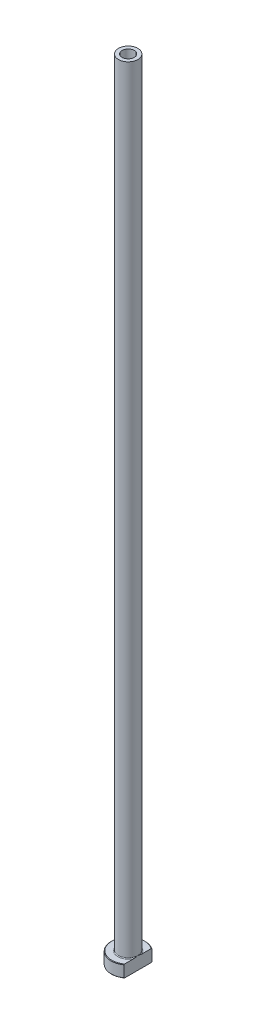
from build123d import *

# Parameters (mm, degrees)
FILLET1_R          = 0.3
CHAMFER1_SIZE      = 0.2
CUT_EXTRUDE1_DEPTH = 326.150734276
CHAMFER2_SIZE      = 0.5


with BuildPart() as part:
    # Sketch1 → Revolve1 (revolve)
    with BuildSketch(Plane.XY, mode=Mode.PRIVATE) as revolve1_sk:
        Polygon((-2.5, 325), (-4, 325), (-4, 5), (-7, 5), (-7, 0), (-2.75, 0), (-2.75, 268), (-2.5, 280), align=None)
    revolve(revolve1_sk.sketch.rotate(Axis((0, 92.187680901, 0), (0, -1, 0)), 270), axis=Axis((0, 92.187680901, 0), (0, -1, 0)))

    # Fillet1
    fillet1_edges = [part.edges().sort_by_distance(p)[0] for p in [
        (0, 5, -4),
    ]]
    fillet(fillet1_edges, radius=FILLET1_R)

    # Chamfer1
    chamfer1_edges = [part.edges().sort_by_distance(p)[0] for p in [
        (0, 0, -7),
        (0, 5, -7),
    ]]
    chamfer(chamfer1_edges, length=CHAMFER1_SIZE)

    # Sketch2 → Cut-Extrude1 (cut, through all)
    with BuildSketch(Plane.XZ):
        with BuildLine():
            Line((4, 5.744562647), (4, -5.744562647))
            ThreePointArc((4, -5.744562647), (7, 0), (4, 5.744562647))
        make_face()
    extrude(amount=-CUT_EXTRUDE1_DEPTH, mode=Mode.SUBTRACT)

    # Chamfer2
    chamfer2_edges = [part.edges().sort_by_distance(p)[0] for p in [
        (0, 0, -2.75),
    ]]
    chamfer(chamfer2_edges, length=CHAMFER2_SIZE)


solid = part.part
